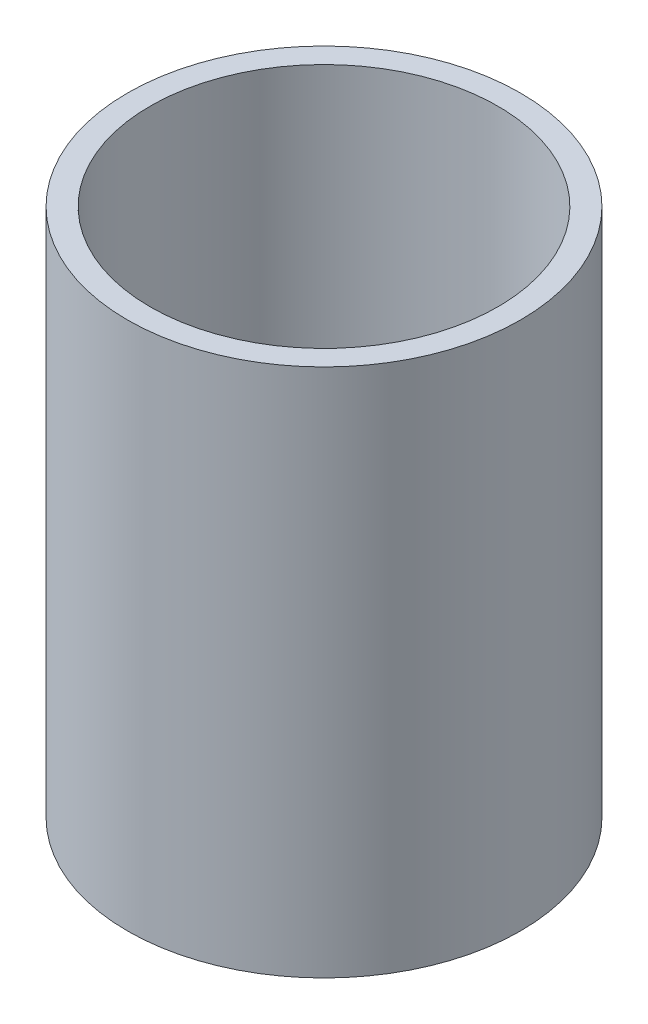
from build123d import *

# Parameters (mm, degrees)
SKETCH1_R           = 26
SKETCH1_R_2         = 23
BOSS_EXTRUDE1_DEPTH = 35


with BuildPart() as part:
    # Sketch1 → Boss-Extrude1 (new, symmetric)
    with BuildSketch(Plane(origin=(0, 0, 0), x_dir=(1, 0, 0), z_dir=(0, 1, 0))):
        with Locations(Location((0, 0, 0), (0, 0, 270))):
            Circle(SKETCH1_R)
        with Locations(Location((0, 0, 0), (0, 0, 270))):
            Circle(SKETCH1_R_2, mode=Mode.SUBTRACT)
    extrude(amount=BOSS_EXTRUDE1_DEPTH, both=True)


solid = part.part
